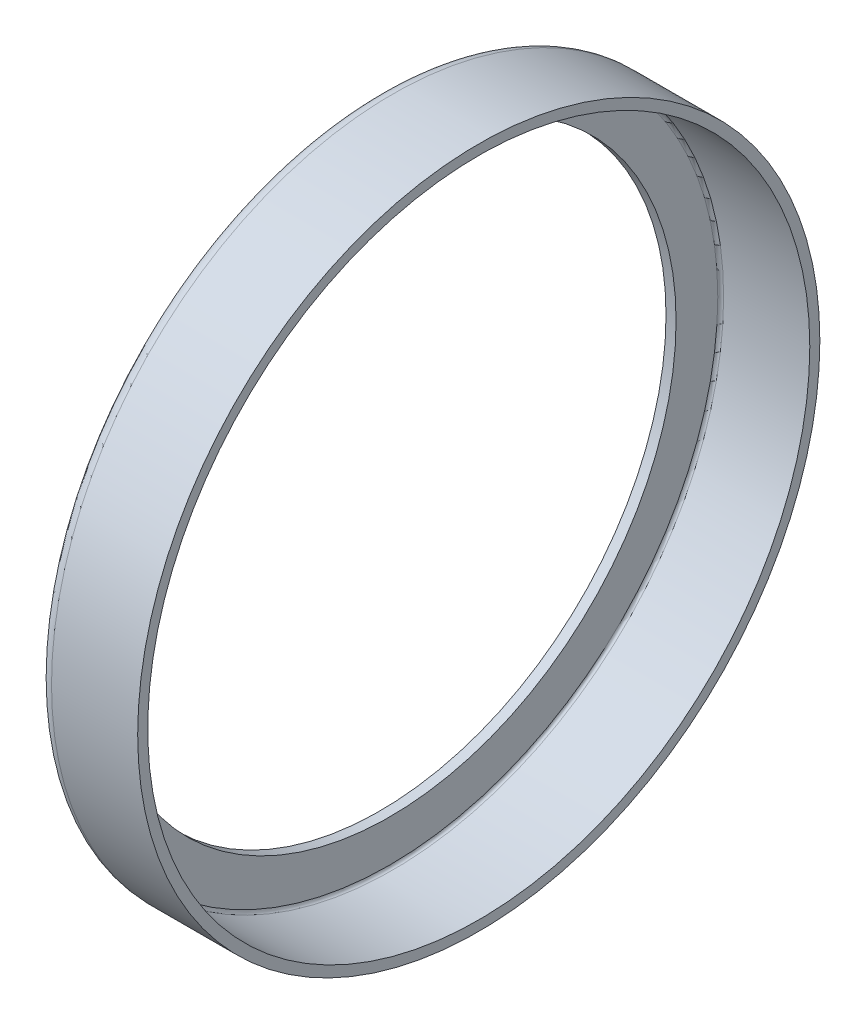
ISO-10303-21;
HEADER;
FILE_DESCRIPTION(('STEP AP214'),'2;1');
FILE_NAME('part.step','',(''),(''),'','','');
FILE_SCHEMA(('AUTOMOTIVE_DESIGN { 1 0 10303 214 1 1 1 1 }'));
ENDSEC;
DATA;
#1=APPLICATION_CONTEXT('core data for automotive mechanical design processes');
#2=APPLICATION_PROTOCOL_DEFINITION('international standard','automotive_design',2000,#1);
#3=PRODUCT_CONTEXT('',#1,'mechanical');
#4=PRODUCT('Part','Part','',(#3));
#5=PRODUCT_RELATED_PRODUCT_CATEGORY('part','',(#4));
#6=PRODUCT_DEFINITION_FORMATION('','',#4);
#7=PRODUCT_DEFINITION_CONTEXT('part definition',#1,'design');
#8=PRODUCT_DEFINITION('design','',#6,#7);
#9=PRODUCT_DEFINITION_SHAPE('','',#8);
#10=(LENGTH_UNIT() NAMED_UNIT(*) SI_UNIT(.MILLI.,.METRE.));
#11=(NAMED_UNIT(*) PLANE_ANGLE_UNIT() SI_UNIT($,.RADIAN.));
#12=(NAMED_UNIT(*) SI_UNIT($,.STERADIAN.) SOLID_ANGLE_UNIT());
#13=UNCERTAINTY_MEASURE_WITH_UNIT(LENGTH_MEASURE(1.E-05),#10,'distance_accuracy_value','');
#14=(GEOMETRIC_REPRESENTATION_CONTEXT(3) GLOBAL_UNCERTAINTY_ASSIGNED_CONTEXT((#13)) GLOBAL_UNIT_ASSIGNED_CONTEXT((#10,
#11,#12)) REPRESENTATION_CONTEXT('',''));
#15=CARTESIAN_POINT('',(0.,0.,0.));
#16=DIRECTION('',(0.,0.,1.));
#17=DIRECTION('',(1.,0.,0.));
#18=AXIS2_PLACEMENT_3D('',#15,#16,#17);
#19=CARTESIAN_POINT('',(-5.99376,0.,17.567506));
#20=DIRECTION('',(1.,0.,0.));
#21=DIRECTION('',(0.,0.,-1.));
#22=AXIS2_PLACEMENT_3D('',#19,#20,#21);
#23=PLANE('',#22);
#24=CARTESIAN_POINT('',(-5.99376,0.,0.));
#25=DIRECTION('',(-1.,0.,0.));
#26=DIRECTION('',(0.,0.,1.));
#27=AXIS2_PLACEMENT_3D('',#24,#25,#26);
#28=CIRCLE('',#27,18.760002);
#29=CARTESIAN_POINT('',(-5.99376,0.,18.760002));
#30=VERTEX_POINT('',#29);
#31=EDGE_CURVE('E41',#30,#30,#28,.T.);
#32=ORIENTED_EDGE('',*,*,#31,.F.);
#33=EDGE_LOOP('',(#32));
#34=FACE_BOUND('',#33,.T.);
#35=CARTESIAN_POINT('',(-5.99376,0.,0.));
#36=DIRECTION('',(1.,0.,0.));
#37=DIRECTION('',(0.,0.,-1.));
#38=AXIS2_PLACEMENT_3D('',#35,#36,#37);
#39=CIRCLE('',#38,16.37501);
#40=CARTESIAN_POINT('',(-5.99376,0.,-16.37501));
#41=VERTEX_POINT('',#40);
#42=EDGE_CURVE('E19',#41,#41,#39,.T.);
#43=ORIENTED_EDGE('',*,*,#42,.F.);
#44=EDGE_LOOP('',(#43));
#45=FACE_BOUND('',#44,.T.);
#46=ADVANCED_FACE('F15',(#34,#45),#23,.T.);
#47=CARTESIAN_POINT('',(-6.56874,0.,0.));
#48=DIRECTION('',(1.,0.,0.));
#49=DIRECTION('',(0.,0.,-1.));
#50=AXIS2_PLACEMENT_3D('',#47,#48,#49);
#51=CYLINDRICAL_SURFACE('',#50,16.37501);
#52=CARTESIAN_POINT('',(-6.56874,0.,0.));
#53=DIRECTION('',(1.,0.,0.));
#54=DIRECTION('',(0.,0.,-1.));
#55=AXIS2_PLACEMENT_3D('',#52,#53,#54);
#56=CIRCLE('',#55,16.37501);
#57=CARTESIAN_POINT('',(-6.56874,0.,-16.37501));
#58=VERTEX_POINT('',#57);
#59=EDGE_CURVE('E38',#58,#58,#56,.T.);
#60=ORIENTED_EDGE('',*,*,#59,.F.);
#61=EDGE_LOOP('',(#60));
#62=FACE_BOUND('',#61,.T.);
#63=ORIENTED_EDGE('',*,*,#42,.T.);
#64=EDGE_LOOP('',(#63));
#65=FACE_BOUND('',#64,.T.);
#66=ADVANCED_FACE('F52',(#62,#65),#51,.F.);
#67=CARTESIAN_POINT('',(-5.827085,0.,0.));
#68=DIRECTION('',(1.,0.,0.));
#69=DIRECTION('',(0.,1.,0.));
#70=AXIS2_PLACEMENT_3D('',#67,#68,#69);
#71=TOROIDAL_SURFACE('',#70,18.760002,0.166675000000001);
#72=CARTESIAN_POINT('',(-5.827085,0.,0.));
#73=DIRECTION('',(-1.,0.,0.));
#74=DIRECTION('',(0.,0.,1.));
#75=AXIS2_PLACEMENT_3D('',#72,#73,#74);
#76=CIRCLE('',#75,18.926677);
#77=CARTESIAN_POINT('',(-5.827085,0.,18.926677));
#78=VERTEX_POINT('',#77);
#79=EDGE_CURVE('E40',#78,#78,#76,.T.);
#80=ORIENTED_EDGE('',*,*,#79,.F.);
#81=EDGE_LOOP('',(#80));
#82=FACE_BOUND('',#81,.T.);
#83=ORIENTED_EDGE('',*,*,#31,.T.);
#84=EDGE_LOOP('',(#83));
#85=FACE_BOUND('',#84,.T.);
#86=ADVANCED_FACE('F61',(#82,#85),#71,.F.);
#87=CARTESIAN_POINT('',(-6.56874,0.,17.567506));
#88=DIRECTION('',(-1.,0.,0.));
#89=DIRECTION('',(0.,0.,1.));
#90=AXIS2_PLACEMENT_3D('',#87,#88,#89);
#91=PLANE('',#90);
#92=ORIENTED_EDGE('',*,*,#59,.T.);
#93=EDGE_LOOP('',(#92));
#94=FACE_BOUND('',#93,.T.);
#95=CARTESIAN_POINT('',(-6.56874,0.,0.));
#96=DIRECTION('',(1.,0.,0.));
#97=DIRECTION('',(0.,0.,1.));
#98=AXIS2_PLACEMENT_3D('',#95,#96,#97);
#99=CIRCLE('',#98,18.760002);
#100=CARTESIAN_POINT('',(-6.56874,0.,18.760002));
#101=VERTEX_POINT('',#100);
#102=EDGE_CURVE('E37',#101,#101,#99,.T.);
#103=ORIENTED_EDGE('',*,*,#102,.F.);
#104=EDGE_LOOP('',(#103));
#105=FACE_BOUND('',#104,.T.);
#106=ADVANCED_FACE('F82',(#94,#105),#91,.T.);
#107=CARTESIAN_POINT('',(-5.827085,0.,0.));
#108=DIRECTION('',(1.,0.,0.));
#109=DIRECTION('',(0.,0.,-1.));
#110=AXIS2_PLACEMENT_3D('',#107,#108,#109);
#111=CYLINDRICAL_SURFACE('',#110,18.926677);
#112=ORIENTED_EDGE('',*,*,#79,.T.);
#113=EDGE_LOOP('',(#112));
#114=FACE_BOUND('',#113,.T.);
#115=CARTESIAN_POINT('',(-0.900007,0.,0.));
#116=DIRECTION('',(1.,0.,0.));
#117=DIRECTION('',(0.,0.,-1.));
#118=AXIS2_PLACEMENT_3D('',#115,#116,#117);
#119=CIRCLE('',#118,18.926677);
#120=CARTESIAN_POINT('',(-0.900007,0.,-18.926677));
#121=VERTEX_POINT('',#120);
#122=EDGE_CURVE('E28',#121,#121,#119,.F.);
#123=ORIENTED_EDGE('',*,*,#122,.F.);
#124=EDGE_LOOP('',(#123));
#125=FACE_BOUND('',#124,.T.);
#126=ADVANCED_FACE('F76',(#114,#125),#111,.F.);
#127=CARTESIAN_POINT('',(-5.827085,0.,0.));
#128=DIRECTION('',(1.,0.,0.));
#129=DIRECTION('',(0.,1.,0.));
#130=AXIS2_PLACEMENT_3D('',#127,#128,#129);
#131=TOROIDAL_SURFACE('',#130,18.760002,0.741655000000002);
#132=ORIENTED_EDGE('',*,*,#102,.T.);
#133=EDGE_LOOP('',(#132));
#134=FACE_BOUND('',#133,.T.);
#135=CARTESIAN_POINT('',(-5.827085,0.,0.));
#136=DIRECTION('',(1.,0.,0.));
#137=DIRECTION('',(0.,0.,-1.));
#138=AXIS2_PLACEMENT_3D('',#135,#136,#137);
#139=CIRCLE('',#138,19.501657);
#140=CARTESIAN_POINT('',(-5.827085,0.,-19.501657));
#141=VERTEX_POINT('',#140);
#142=EDGE_CURVE('E23',#141,#141,#139,.T.);
#143=ORIENTED_EDGE('',*,*,#142,.F.);
#144=EDGE_LOOP('',(#143));
#145=FACE_BOUND('',#144,.T.);
#146=ADVANCED_FACE('F71',(#134,#145),#131,.T.);
#147=CARTESIAN_POINT('',(-0.900007,0.,19.214167));
#148=DIRECTION('',(1.,0.,0.));
#149=DIRECTION('',(0.,0.,-1.));
#150=AXIS2_PLACEMENT_3D('',#147,#148,#149);
#151=PLANE('',#150);
#152=CARTESIAN_POINT('',(-0.900007,0.,0.));
#153=DIRECTION('',(1.,0.,0.));
#154=DIRECTION('',(0.,0.,-1.));
#155=AXIS2_PLACEMENT_3D('',#152,#153,#154);
#156=CIRCLE('',#155,19.501657);
#157=CARTESIAN_POINT('',(-0.900007,0.,-19.501657));
#158=VERTEX_POINT('',#157);
#159=EDGE_CURVE('E10',#158,#158,#156,.F.);
#160=ORIENTED_EDGE('',*,*,#159,.F.);
#161=EDGE_LOOP('',(#160));
#162=FACE_BOUND('',#161,.T.);
#163=ORIENTED_EDGE('',*,*,#122,.T.);
#164=EDGE_LOOP('',(#163));
#165=FACE_BOUND('',#164,.T.);
#166=ADVANCED_FACE('F66',(#162,#165),#151,.T.);
#167=CARTESIAN_POINT('',(-3.363546,0.,0.));
#168=DIRECTION('',(1.,0.,0.));
#169=DIRECTION('',(0.,0.,-1.));
#170=AXIS2_PLACEMENT_3D('',#167,#168,#169);
#171=CYLINDRICAL_SURFACE('',#170,19.501657);
#172=ORIENTED_EDGE('',*,*,#142,.T.);
#173=EDGE_LOOP('',(#172));
#174=FACE_BOUND('',#173,.T.);
#175=ORIENTED_EDGE('',*,*,#159,.T.);
#176=EDGE_LOOP('',(#175));
#177=FACE_BOUND('',#176,.T.);
#178=ADVANCED_FACE('F17',(#174,#177),#171,.T.);
#179=CLOSED_SHELL('',(#46,#66,#86,#106,#126,#146,#166,#178));
#180=MANIFOLD_SOLID_BREP('B1',#179);
#181=ADVANCED_BREP_SHAPE_REPRESENTATION('',(#18,#180),#14);
#182=SHAPE_DEFINITION_REPRESENTATION(#9,#181);
ENDSEC;
END-ISO-10303-21;
